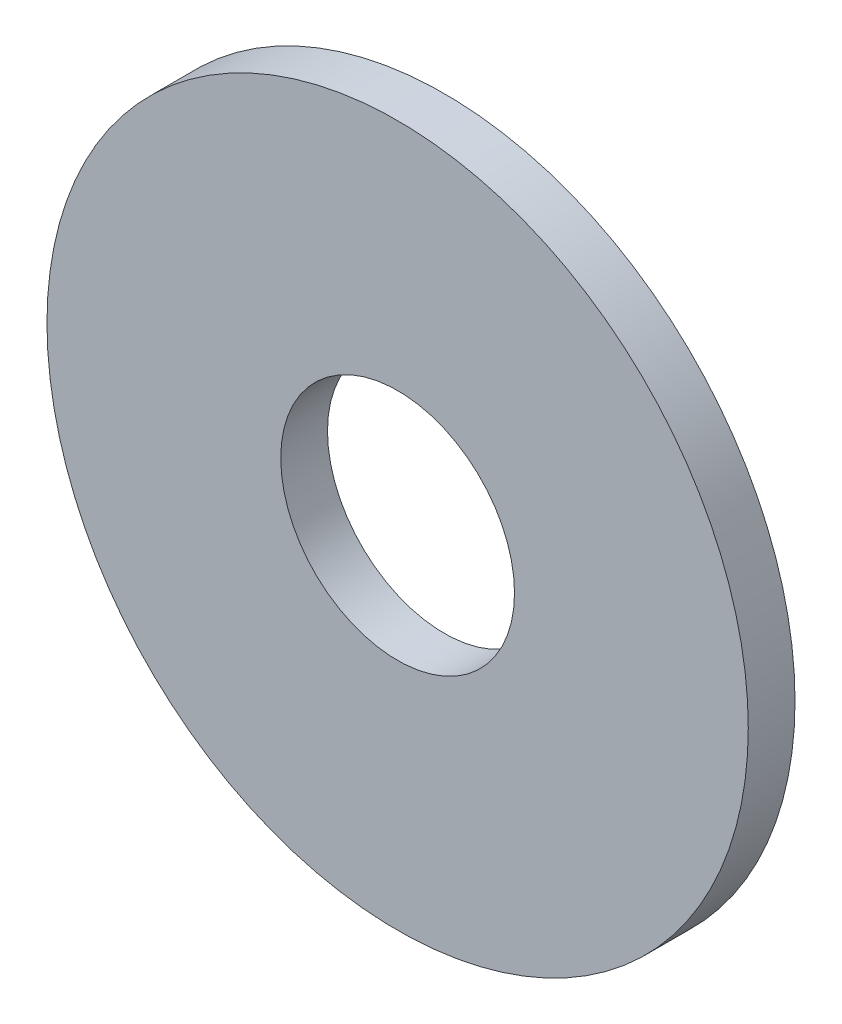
from build123d import *

# Parameters (mm, degrees)
ESQUISSE1_R      = 9
ESQUISSE1_R_2    = 3
EXTRUSION1_DEPTH = 1.2


with BuildPart() as part:
    # Esquisse1 → Extrusion1 (new body)
    with BuildSketch(Plane.XY):
        Circle(ESQUISSE1_R)
        Circle(ESQUISSE1_R_2, mode=Mode.SUBTRACT)
    extrude(amount=EXTRUSION1_DEPTH)


solid = part.part
